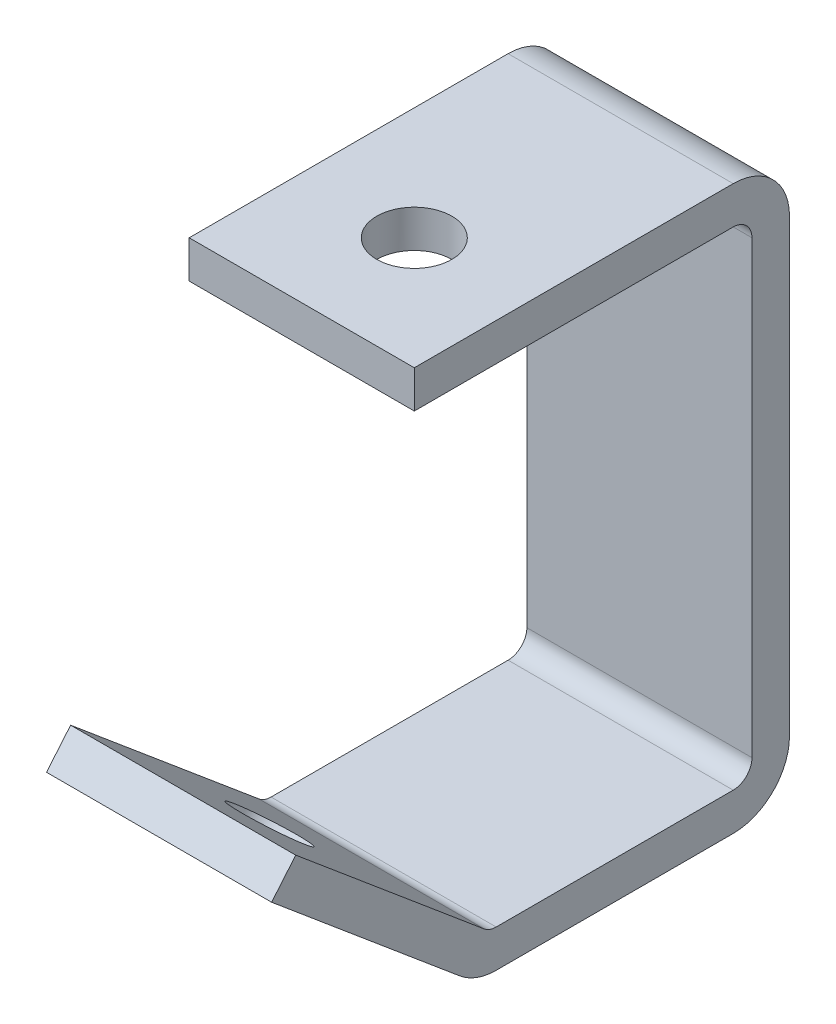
ISO-10303-21;
HEADER;
FILE_DESCRIPTION(('STEP AP214'),'2;1');
FILE_NAME('part.step','',(''),(''),'','','');
FILE_SCHEMA(('AUTOMOTIVE_DESIGN { 1 0 10303 214 1 1 1 1 }'));
ENDSEC;
DATA;
#1=APPLICATION_CONTEXT('core data for automotive mechanical design processes');
#2=APPLICATION_PROTOCOL_DEFINITION('international standard','automotive_design',2000,#1);
#3=PRODUCT_CONTEXT('',#1,'mechanical');
#4=PRODUCT('Part','Part','',(#3));
#5=PRODUCT_RELATED_PRODUCT_CATEGORY('part','',(#4));
#6=PRODUCT_DEFINITION_FORMATION('','',#4);
#7=PRODUCT_DEFINITION_CONTEXT('part definition',#1,'design');
#8=PRODUCT_DEFINITION('design','',#6,#7);
#9=PRODUCT_DEFINITION_SHAPE('','',#8);
#10=(LENGTH_UNIT() NAMED_UNIT(*) SI_UNIT(.MILLI.,.METRE.));
#11=(NAMED_UNIT(*) PLANE_ANGLE_UNIT() SI_UNIT($,.RADIAN.));
#12=(NAMED_UNIT(*) SI_UNIT($,.STERADIAN.) SOLID_ANGLE_UNIT());
#13=UNCERTAINTY_MEASURE_WITH_UNIT(LENGTH_MEASURE(1.E-05),#10,'distance_accuracy_value','');
#14=(GEOMETRIC_REPRESENTATION_CONTEXT(3) GLOBAL_UNCERTAINTY_ASSIGNED_CONTEXT((#13)) GLOBAL_UNIT_ASSIGNED_CONTEXT((#10,
#11,#12)) REPRESENTATION_CONTEXT('',''));
#15=CARTESIAN_POINT('',(0.,0.,0.));
#16=DIRECTION('',(0.,0.,1.));
#17=DIRECTION('',(1.,0.,0.));
#18=AXIS2_PLACEMENT_3D('',#15,#16,#17);
#19=CARTESIAN_POINT('',(19.05,88.9,3.175));
#20=DIRECTION('',(0.,-1.,0.));
#21=DIRECTION('',(0.,0.,-1.));
#22=AXIS2_PLACEMENT_3D('',#19,#20,#21);
#23=PLANE('',#22);
#24=CARTESIAN_POINT('',(0.,88.9,38.1));
#25=DIRECTION('',(0.,1.,0.));
#26=DIRECTION('',(0.,0.,1.));
#27=AXIS2_PLACEMENT_3D('',#24,#25,#26);
#28=CIRCLE('',#27,6.35);
#29=CARTESIAN_POINT('',(0.,88.9,44.45));
#30=VERTEX_POINT('',#29);
#31=EDGE_CURVE('E179',#30,#30,#28,.T.);
#32=ORIENTED_EDGE('',*,*,#31,.F.);
#33=EDGE_LOOP('',(#32));
#34=FACE_BOUND('',#33,.T.);
#35=DIRECTION('',(0.,0.,1.));
#36=VECTOR('',#35,1.);
#37=CARTESIAN_POINT('',(-19.05,88.9,3.175));
#38=LINE('',#37,#36);
#39=CARTESIAN_POINT('',(-19.05,88.9,3.175));
#40=VERTEX_POINT('',#39);
#41=CARTESIAN_POINT('',(-19.05,88.9,57.15));
#42=VERTEX_POINT('',#41);
#43=EDGE_CURVE('E175',#40,#42,#38,.T.);
#44=ORIENTED_EDGE('',*,*,#43,.T.);
#45=DIRECTION('',(-1.,0.,0.));
#46=VECTOR('',#45,1.);
#47=CARTESIAN_POINT('',(19.05,88.9,57.15));
#48=LINE('',#47,#46);
#49=CARTESIAN_POINT('',(19.05,88.9,57.15));
#50=VERTEX_POINT('',#49);
#51=EDGE_CURVE('E11',#50,#42,#48,.T.);
#52=ORIENTED_EDGE('',*,*,#51,.F.);
#53=DIRECTION('',(0.,0.,1.));
#54=VECTOR('',#53,1.);
#55=CARTESIAN_POINT('',(19.05,88.9,3.175));
#56=LINE('',#55,#54);
#57=CARTESIAN_POINT('',(19.05,88.9,3.175));
#58=VERTEX_POINT('',#57);
#59=EDGE_CURVE('E112',#58,#50,#56,.T.);
#60=ORIENTED_EDGE('',*,*,#59,.F.);
#61=DIRECTION('',(-1.,0.,0.));
#62=VECTOR('',#61,1.);
#63=CARTESIAN_POINT('',(19.05,88.9,3.175));
#64=LINE('',#63,#62);
#65=EDGE_CURVE('E171',#58,#40,#64,.T.);
#66=ORIENTED_EDGE('',*,*,#65,.T.);
#67=EDGE_LOOP('',(#44,#52,#60,#66));
#68=FACE_BOUND('',#67,.T.);
#69=ADVANCED_FACE('F32',(#34,#68),#23,.F.);
#70=CARTESIAN_POINT('',(19.05,82.55,57.15));
#71=DIRECTION('',(0.,0.,1.));
#72=DIRECTION('',(1.,0.,0.));
#73=AXIS2_PLACEMENT_3D('',#70,#71,#72);
#74=PLANE('',#73);
#75=DIRECTION('',(0.,1.,0.));
#76=VECTOR('',#75,1.);
#77=CARTESIAN_POINT('',(-19.05,82.55,57.15));
#78=LINE('',#77,#76);
#79=CARTESIAN_POINT('',(-19.05,82.55,57.15));
#80=VERTEX_POINT('',#79);
#81=EDGE_CURVE('E178',#80,#42,#78,.T.);
#82=ORIENTED_EDGE('',*,*,#81,.F.);
#83=DIRECTION('',(-1.,0.,0.));
#84=VECTOR('',#83,1.);
#85=CARTESIAN_POINT('',(19.05,82.55,57.15));
#86=LINE('',#85,#84);
#87=CARTESIAN_POINT('',(19.05,82.55,57.15));
#88=VERTEX_POINT('',#87);
#89=EDGE_CURVE('E40',#88,#80,#86,.T.);
#90=ORIENTED_EDGE('',*,*,#89,.F.);
#91=DIRECTION('',(0.,1.,0.));
#92=VECTOR('',#91,1.);
#93=CARTESIAN_POINT('',(19.05,82.55,57.15));
#94=LINE('',#93,#92);
#95=EDGE_CURVE('E261',#88,#50,#94,.T.);
#96=ORIENTED_EDGE('',*,*,#95,.T.);
#97=ORIENTED_EDGE('',*,*,#51,.T.);
#98=EDGE_LOOP('',(#82,#90,#96,#97));
#99=FACE_BOUND('',#98,.T.);
#100=ADVANCED_FACE('F248',(#99),#74,.T.);
#101=CARTESIAN_POINT('',(19.05,82.55,3.175));
#102=DIRECTION('',(0.,-1.,0.));
#103=DIRECTION('',(0.,0.,-1.));
#104=AXIS2_PLACEMENT_3D('',#101,#102,#103);
#105=PLANE('',#104);
#106=CARTESIAN_POINT('',(0.,82.55,38.1));
#107=DIRECTION('',(0.,-1.,0.));
#108=DIRECTION('',(0.,0.,-1.));
#109=AXIS2_PLACEMENT_3D('',#106,#107,#108);
#110=CIRCLE('',#109,6.35);
#111=CARTESIAN_POINT('',(0.,82.55,31.75));
#112=VERTEX_POINT('',#111);
#113=EDGE_CURVE('E317',#112,#112,#110,.F.);
#114=ORIENTED_EDGE('',*,*,#113,.T.);
#115=EDGE_LOOP('',(#114));
#116=FACE_BOUND('',#115,.T.);
#117=DIRECTION('',(0.,0.,1.));
#118=VECTOR('',#117,1.);
#119=CARTESIAN_POINT('',(-19.05,82.55,3.175));
#120=LINE('',#119,#118);
#121=CARTESIAN_POINT('',(-19.05,82.55,3.175));
#122=VERTEX_POINT('',#121);
#123=EDGE_CURVE('E182',#122,#80,#120,.T.);
#124=ORIENTED_EDGE('',*,*,#123,.F.);
#125=DIRECTION('',(-1.,0.,0.));
#126=VECTOR('',#125,1.);
#127=CARTESIAN_POINT('',(19.05,82.55,3.175));
#128=LINE('',#127,#126);
#129=CARTESIAN_POINT('',(19.05,82.55,3.175));
#130=VERTEX_POINT('',#129);
#131=EDGE_CURVE('E238',#130,#122,#128,.T.);
#132=ORIENTED_EDGE('',*,*,#131,.F.);
#133=DIRECTION('',(0.,0.,1.));
#134=VECTOR('',#133,1.);
#135=CARTESIAN_POINT('',(19.05,82.55,3.175));
#136=LINE('',#135,#134);
#137=EDGE_CURVE('E245',#130,#88,#136,.T.);
#138=ORIENTED_EDGE('',*,*,#137,.T.);
#139=ORIENTED_EDGE('',*,*,#89,.T.);
#140=EDGE_LOOP('',(#124,#132,#138,#139));
#141=FACE_BOUND('',#140,.T.);
#142=ADVANCED_FACE('F243',(#116,#141),#105,.T.);
#143=CARTESIAN_POINT('',(19.05,79.375,3.175));
#144=DIRECTION('',(-1.,0.,0.));
#145=DIRECTION('',(0.,0.,1.));
#146=AXIS2_PLACEMENT_3D('',#143,#144,#145);
#147=CYLINDRICAL_SURFACE('',#146,3.175);
#148=CARTESIAN_POINT('',(-19.05,79.375,3.175));
#149=DIRECTION('',(1.,0.,0.));
#150=DIRECTION('',(0.,0.,-1.));
#151=AXIS2_PLACEMENT_3D('',#148,#149,#150);
#152=CIRCLE('',#151,3.175);
#153=CARTESIAN_POINT('',(-19.05,79.375,0.));
#154=VERTEX_POINT('',#153);
#155=EDGE_CURVE('E185',#154,#122,#152,.T.);
#156=ORIENTED_EDGE('',*,*,#155,.F.);
#157=DIRECTION('',(-1.,0.,0.));
#158=VECTOR('',#157,1.);
#159=CARTESIAN_POINT('',(19.05,79.375,0.));
#160=LINE('',#159,#158);
#161=CARTESIAN_POINT('',(19.05,79.375,0.));
#162=VERTEX_POINT('',#161);
#163=EDGE_CURVE('E236',#162,#154,#160,.T.);
#164=ORIENTED_EDGE('',*,*,#163,.F.);
#165=CARTESIAN_POINT('',(19.05,79.375,3.175));
#166=DIRECTION('',(1.,0.,0.));
#167=DIRECTION('',(0.,0.,-1.));
#168=AXIS2_PLACEMENT_3D('',#165,#166,#167);
#169=CIRCLE('',#168,3.175);
#170=EDGE_CURVE('E258',#162,#130,#169,.T.);
#171=ORIENTED_EDGE('',*,*,#170,.T.);
#172=ORIENTED_EDGE('',*,*,#131,.T.);
#173=EDGE_LOOP('',(#156,#164,#171,#172));
#174=FACE_BOUND('',#173,.T.);
#175=ADVANCED_FACE('F255',(#174),#147,.F.);
#176=CARTESIAN_POINT('',(19.05,3.175,0.));
#177=DIRECTION('',(0.,0.,1.));
#178=DIRECTION('',(1.,0.,0.));
#179=AXIS2_PLACEMENT_3D('',#176,#177,#178);
#180=PLANE('',#179);
#181=DIRECTION('',(0.,1.,0.));
#182=VECTOR('',#181,1.);
#183=CARTESIAN_POINT('',(-19.05,3.175,0.));
#184=LINE('',#183,#182);
#185=CARTESIAN_POINT('',(-19.05,3.175,0.));
#186=VERTEX_POINT('',#185);
#187=EDGE_CURVE('E188',#186,#154,#184,.T.);
#188=ORIENTED_EDGE('',*,*,#187,.F.);
#189=DIRECTION('',(-1.,0.,0.));
#190=VECTOR('',#189,1.);
#191=CARTESIAN_POINT('',(19.05,3.175,0.));
#192=LINE('',#191,#190);
#193=CARTESIAN_POINT('',(19.05,3.175,0.));
#194=VERTEX_POINT('',#193);
#195=EDGE_CURVE('E234',#194,#186,#192,.T.);
#196=ORIENTED_EDGE('',*,*,#195,.F.);
#197=DIRECTION('',(0.,1.,0.));
#198=VECTOR('',#197,1.);
#199=CARTESIAN_POINT('',(19.05,3.175,0.));
#200=LINE('',#199,#198);
#201=EDGE_CURVE('E263',#194,#162,#200,.T.);
#202=ORIENTED_EDGE('',*,*,#201,.T.);
#203=ORIENTED_EDGE('',*,*,#163,.T.);
#204=EDGE_LOOP('',(#188,#196,#202,#203));
#205=FACE_BOUND('',#204,.T.);
#206=ADVANCED_FACE('F362',(#205),#180,.T.);
#207=CARTESIAN_POINT('',(19.05,3.175,3.175));
#208=DIRECTION('',(-1.,0.,0.));
#209=DIRECTION('',(0.,0.,1.));
#210=AXIS2_PLACEMENT_3D('',#207,#208,#209);
#211=CYLINDRICAL_SURFACE('',#210,3.175);
#212=CARTESIAN_POINT('',(-19.05,3.175,3.175));
#213=DIRECTION('',(1.,0.,0.));
#214=DIRECTION('',(0.,0.,1.));
#215=AXIS2_PLACEMENT_3D('',#212,#213,#214);
#216=CIRCLE('',#215,3.175);
#217=CARTESIAN_POINT('',(-19.05,0.,3.175));
#218=VERTEX_POINT('',#217);
#219=EDGE_CURVE('E191',#218,#186,#216,.T.);
#220=ORIENTED_EDGE('',*,*,#219,.F.);
#221=DIRECTION('',(-1.,0.,0.));
#222=VECTOR('',#221,1.);
#223=CARTESIAN_POINT('',(19.05,0.,3.175));
#224=LINE('',#223,#222);
#225=CARTESIAN_POINT('',(19.05,0.,3.175));
#226=VERTEX_POINT('',#225);
#227=EDGE_CURVE('E232',#226,#218,#224,.T.);
#228=ORIENTED_EDGE('',*,*,#227,.F.);
#229=CARTESIAN_POINT('',(19.05,3.175,3.175));
#230=DIRECTION('',(1.,0.,0.));
#231=DIRECTION('',(0.,0.,1.));
#232=AXIS2_PLACEMENT_3D('',#229,#230,#231);
#233=CIRCLE('',#232,3.175);
#234=EDGE_CURVE('E269',#226,#194,#233,.T.);
#235=ORIENTED_EDGE('',*,*,#234,.T.);
#236=ORIENTED_EDGE('',*,*,#195,.T.);
#237=EDGE_LOOP('',(#220,#228,#235,#236));
#238=FACE_BOUND('',#237,.T.);
#239=ADVANCED_FACE('F360',(#238),#211,.F.);
#240=CARTESIAN_POINT('',(19.05,0.,43.2943945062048));
#241=DIRECTION('',(0.,1.,0.));
#242=DIRECTION('',(0.,0.,1.));
#243=AXIS2_PLACEMENT_3D('',#240,#241,#242);
#244=PLANE('',#243);
#245=DIRECTION('',(0.,0.,-1.));
#246=VECTOR('',#245,1.);
#247=CARTESIAN_POINT('',(-19.05,0.,43.2943945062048));
#248=LINE('',#247,#246);
#249=CARTESIAN_POINT('',(-19.05,0.,43.2943945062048));
#250=VERTEX_POINT('',#249);
#251=EDGE_CURVE('E194',#250,#218,#248,.T.);
#252=ORIENTED_EDGE('',*,*,#251,.F.);
#253=DIRECTION('',(-1.,0.,0.));
#254=VECTOR('',#253,1.);
#255=CARTESIAN_POINT('',(19.05,0.,43.2943945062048));
#256=LINE('',#255,#254);
#257=CARTESIAN_POINT('',(19.05,0.,43.2943945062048));
#258=VERTEX_POINT('',#257);
#259=EDGE_CURVE('E230',#258,#250,#256,.T.);
#260=ORIENTED_EDGE('',*,*,#259,.F.);
#261=DIRECTION('',(0.,0.,-1.));
#262=VECTOR('',#261,1.);
#263=CARTESIAN_POINT('',(19.05,0.,43.2943945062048));
#264=LINE('',#263,#262);
#265=EDGE_CURVE('E272',#258,#226,#264,.T.);
#266=ORIENTED_EDGE('',*,*,#265,.T.);
#267=ORIENTED_EDGE('',*,*,#227,.T.);
#268=EDGE_LOOP('',(#252,#260,#266,#267));
#269=FACE_BOUND('',#268,.T.);
#270=ADVANCED_FACE('F356',(#269),#244,.T.);
#271=CARTESIAN_POINT('',(19.05,3.175,43.2943945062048));
#272=DIRECTION('',(-1.,0.,0.));
#273=DIRECTION('',(0.,0.,1.));
#274=AXIS2_PLACEMENT_3D('',#271,#272,#273);
#275=CYLINDRICAL_SURFACE('',#274,3.175);
#276=CARTESIAN_POINT('',(-19.05,3.175,43.2943945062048));
#277=DIRECTION('',(1.,0.,0.));
#278=DIRECTION('',(0.,0.,-1.));
#279=AXIS2_PLACEMENT_3D('',#276,#277,#278);
#280=CIRCLE('',#279,3.175);
#281=CARTESIAN_POINT('',(-19.05,0.742808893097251,45.3352451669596));
#282=VERTEX_POINT('',#281);
#283=EDGE_CURVE('E197',#282,#250,#280,.T.);
#284=ORIENTED_EDGE('',*,*,#283,.F.);
#285=DIRECTION('',(-1.,0.,0.));
#286=VECTOR('',#285,1.);
#287=CARTESIAN_POINT('',(19.05,0.742808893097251,45.3352451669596));
#288=LINE('',#287,#286);
#289=CARTESIAN_POINT('',(19.05,0.742808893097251,45.3352451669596));
#290=VERTEX_POINT('',#289);
#291=EDGE_CURVE('E228',#290,#282,#288,.T.);
#292=ORIENTED_EDGE('',*,*,#291,.F.);
#293=CARTESIAN_POINT('',(19.05,3.175,43.2943945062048));
#294=DIRECTION('',(1.,0.,0.));
#295=DIRECTION('',(0.,0.,-1.));
#296=AXIS2_PLACEMENT_3D('',#293,#294,#295);
#297=CIRCLE('',#296,3.175);
#298=EDGE_CURVE('E275',#290,#258,#297,.T.);
#299=ORIENTED_EDGE('',*,*,#298,.T.);
#300=ORIENTED_EDGE('',*,*,#259,.T.);
#301=EDGE_LOOP('',(#284,#292,#299,#300));
#302=FACE_BOUND('',#301,.T.);
#303=ADVANCED_FACE('F352',(#302),#275,.F.);
#304=CARTESIAN_POINT('',(19.05,27.4943401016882,77.2164785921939));
#305=DIRECTION('',(0.,0.766044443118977,-0.64278760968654));
#306=DIRECTION('',(0.,0.64278760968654,0.766044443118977));
#307=AXIS2_PLACEMENT_3D('',#304,#305,#306);
#308=PLANE('',#307);
#309=CARTESIAN_POINT('',(0.,15.2389046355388,62.6110193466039));
#310=DIRECTION('',(0.,0.766044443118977,-0.64278760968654));
#311=DIRECTION('',(0.,0.64278760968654,0.766044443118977));
#312=AXIS2_PLACEMENT_3D('',#309,#310,#311);
#313=CIRCLE('',#312,6.);
#314=CARTESIAN_POINT('',(0.,19.095630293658,67.2072860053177));
#315=VERTEX_POINT('',#314);
#316=EDGE_CURVE('E325',#315,#315,#313,.F.);
#317=ORIENTED_EDGE('',*,*,#316,.T.);
#318=EDGE_LOOP('',(#317));
#319=FACE_BOUND('',#318,.T.);
#320=DIRECTION('',(0.,-0.64278760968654,-0.766044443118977));
#321=VECTOR('',#320,1.);
#322=CARTESIAN_POINT('',(-19.05,27.4943401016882,77.2164785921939));
#323=LINE('',#322,#321);
#324=CARTESIAN_POINT('',(-19.05,27.4943401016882,77.2164785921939));
#325=VERTEX_POINT('',#324);
#326=EDGE_CURVE('E200',#325,#282,#323,.T.);
#327=ORIENTED_EDGE('',*,*,#326,.F.);
#328=DIRECTION('',(-1.,0.,0.));
#329=VECTOR('',#328,1.);
#330=CARTESIAN_POINT('',(19.05,27.4943401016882,77.2164785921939));
#331=LINE('',#330,#329);
#332=CARTESIAN_POINT('',(19.05,27.4943401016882,77.2164785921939));
#333=VERTEX_POINT('',#332);
#334=EDGE_CURVE('E226',#333,#325,#331,.T.);
#335=ORIENTED_EDGE('',*,*,#334,.F.);
#336=DIRECTION('',(0.,-0.64278760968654,-0.766044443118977));
#337=VECTOR('',#336,1.);
#338=CARTESIAN_POINT('',(19.05,27.4943401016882,77.2164785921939));
#339=LINE('',#338,#337);
#340=EDGE_CURVE('E278',#333,#290,#339,.T.);
#341=ORIENTED_EDGE('',*,*,#340,.T.);
#342=ORIENTED_EDGE('',*,*,#291,.T.);
#343=EDGE_LOOP('',(#327,#335,#341,#342));
#344=FACE_BOUND('',#343,.T.);
#345=ADVANCED_FACE('F329',(#319,#344),#308,.T.);
#346=CARTESIAN_POINT('',(19.05,22.6299578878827,81.2981799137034));
#347=DIRECTION('',(0.,0.642787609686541,0.766044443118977));
#348=DIRECTION('',(0.,-0.766044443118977,0.642787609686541));
#349=AXIS2_PLACEMENT_3D('',#346,#347,#348);
#350=PLANE('',#349);
#351=DIRECTION('',(0.,0.766044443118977,-0.642787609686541));
#352=VECTOR('',#351,1.);
#353=CARTESIAN_POINT('',(-19.05,22.6299578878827,81.2981799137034));
#354=LINE('',#353,#352);
#355=CARTESIAN_POINT('',(-19.05,22.6299578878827,81.2981799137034));
#356=VERTEX_POINT('',#355);
#357=EDGE_CURVE('E203',#356,#325,#354,.T.);
#358=ORIENTED_EDGE('',*,*,#357,.F.);
#359=DIRECTION('',(-1.,0.,0.));
#360=VECTOR('',#359,1.);
#361=CARTESIAN_POINT('',(19.05,22.6299578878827,81.2981799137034));
#362=LINE('',#361,#360);
#363=CARTESIAN_POINT('',(19.05,22.6299578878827,81.2981799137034));
#364=VERTEX_POINT('',#363);
#365=EDGE_CURVE('E224',#364,#356,#362,.T.);
#366=ORIENTED_EDGE('',*,*,#365,.F.);
#367=DIRECTION('',(0.,0.766044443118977,-0.642787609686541));
#368=VECTOR('',#367,1.);
#369=CARTESIAN_POINT('',(19.05,22.6299578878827,81.2981799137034));
#370=LINE('',#369,#368);
#371=EDGE_CURVE('E281',#364,#333,#370,.T.);
#372=ORIENTED_EDGE('',*,*,#371,.T.);
#373=ORIENTED_EDGE('',*,*,#334,.T.);
#374=EDGE_LOOP('',(#358,#366,#372,#373));
#375=FACE_BOUND('',#374,.T.);
#376=ADVANCED_FACE('F342',(#375),#350,.T.);
#377=CARTESIAN_POINT('',(19.05,22.6299578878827,81.2981799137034));
#378=DIRECTION('',(0.,0.766044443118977,-0.64278760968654));
#379=DIRECTION('',(0.,0.64278760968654,0.766044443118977));
#380=AXIS2_PLACEMENT_3D('',#377,#378,#379);
#381=PLANE('',#380);
#382=CARTESIAN_POINT('',(0.,10.3745224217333,66.6927206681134));
#383=DIRECTION('',(0.,-0.766044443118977,0.64278760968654));
#384=DIRECTION('',(0.,-0.64278760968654,-0.766044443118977));
#385=AXIS2_PLACEMENT_3D('',#382,#383,#384);
#386=CIRCLE('',#385,6.);
#387=CARTESIAN_POINT('',(0.,6.51779676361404,62.0964540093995));
#388=VERTEX_POINT('',#387);
#389=EDGE_CURVE('E320',#388,#388,#386,.T.);
#390=ORIENTED_EDGE('',*,*,#389,.F.);
#391=EDGE_LOOP('',(#390));
#392=FACE_BOUND('',#391,.T.);
#393=DIRECTION('',(0.,-0.64278760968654,-0.766044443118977));
#394=VECTOR('',#393,1.);
#395=CARTESIAN_POINT('',(-19.05,22.6299578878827,81.2981799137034));
#396=LINE('',#395,#394);
#397=CARTESIAN_POINT('',(-19.05,-4.12157332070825,49.4169464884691));
#398=VERTEX_POINT('',#397);
#399=EDGE_CURVE('E206',#356,#398,#396,.T.);
#400=ORIENTED_EDGE('',*,*,#399,.T.);
#401=DIRECTION('',(-1.,0.,0.));
#402=VECTOR('',#401,1.);
#403=CARTESIAN_POINT('',(19.05,-4.12157332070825,49.4169464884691));
#404=LINE('',#403,#402);
#405=CARTESIAN_POINT('',(19.05,-4.12157332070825,49.4169464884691));
#406=VERTEX_POINT('',#405);
#407=EDGE_CURVE('E221',#406,#398,#404,.T.);
#408=ORIENTED_EDGE('',*,*,#407,.F.);
#409=DIRECTION('',(0.,-0.64278760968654,-0.766044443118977));
#410=VECTOR('',#409,1.);
#411=CARTESIAN_POINT('',(19.05,22.6299578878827,81.2981799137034));
#412=LINE('',#411,#410);
#413=EDGE_CURVE('E284',#364,#406,#412,.T.);
#414=ORIENTED_EDGE('',*,*,#413,.F.);
#415=ORIENTED_EDGE('',*,*,#365,.T.);
#416=EDGE_LOOP('',(#400,#408,#414,#415));
#417=FACE_BOUND('',#416,.T.);
#418=ADVANCED_FACE('F339',(#392,#417),#381,.F.);
#419=CARTESIAN_POINT('',(19.05,3.175,43.2943945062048));
#420=DIRECTION('',(-1.,0.,0.));
#421=DIRECTION('',(0.,0.,1.));
#422=AXIS2_PLACEMENT_3D('',#419,#420,#421);
#423=CYLINDRICAL_SURFACE('',#422,9.525);
#424=CARTESIAN_POINT('',(-19.05,3.175,43.2943945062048));
#425=DIRECTION('',(1.,0.,0.));
#426=DIRECTION('',(0.,0.,-1.));
#427=AXIS2_PLACEMENT_3D('',#424,#425,#426);
#428=CIRCLE('',#427,9.525);
#429=CARTESIAN_POINT('',(-19.05,-6.35,43.2943945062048));
#430=VERTEX_POINT('',#429);
#431=EDGE_CURVE('E208',#398,#430,#428,.T.);
#432=ORIENTED_EDGE('',*,*,#431,.T.);
#433=DIRECTION('',(-1.,0.,0.));
#434=VECTOR('',#433,1.);
#435=CARTESIAN_POINT('',(19.05,-6.35,43.2943945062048));
#436=LINE('',#435,#434);
#437=CARTESIAN_POINT('',(19.05,-6.35,43.2943945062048));
#438=VERTEX_POINT('',#437);
#439=EDGE_CURVE('E218',#438,#430,#436,.T.);
#440=ORIENTED_EDGE('',*,*,#439,.F.);
#441=CARTESIAN_POINT('',(19.05,3.175,43.2943945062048));
#442=DIRECTION('',(1.,0.,0.));
#443=DIRECTION('',(0.,0.,-1.));
#444=AXIS2_PLACEMENT_3D('',#441,#442,#443);
#445=CIRCLE('',#444,9.525);
#446=EDGE_CURVE('E286',#406,#438,#445,.T.);
#447=ORIENTED_EDGE('',*,*,#446,.F.);
#448=ORIENTED_EDGE('',*,*,#407,.T.);
#449=EDGE_LOOP('',(#432,#440,#447,#448));
#450=FACE_BOUND('',#449,.T.);
#451=ADVANCED_FACE('F293',(#450),#423,.T.);
#452=CARTESIAN_POINT('',(19.05,-6.35,43.2943945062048));
#453=DIRECTION('',(0.,1.,0.));
#454=DIRECTION('',(0.,0.,1.));
#455=AXIS2_PLACEMENT_3D('',#452,#453,#454);
#456=PLANE('',#455);
#457=DIRECTION('',(0.,0.,-1.));
#458=VECTOR('',#457,1.);
#459=CARTESIAN_POINT('',(-19.05,-6.35,43.2943945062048));
#460=LINE('',#459,#458);
#461=CARTESIAN_POINT('',(-19.05,-6.35,3.17499999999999));
#462=VERTEX_POINT('',#461);
#463=EDGE_CURVE('E210',#430,#462,#460,.T.);
#464=ORIENTED_EDGE('',*,*,#463,.T.);
#465=DIRECTION('',(-1.,0.,0.));
#466=VECTOR('',#465,1.);
#467=CARTESIAN_POINT('',(19.05,-6.35,3.17499999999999));
#468=LINE('',#467,#466);
#469=CARTESIAN_POINT('',(19.05,-6.35,3.17499999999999));
#470=VERTEX_POINT('',#469);
#471=EDGE_CURVE('E166',#470,#462,#468,.T.);
#472=ORIENTED_EDGE('',*,*,#471,.F.);
#473=DIRECTION('',(0.,0.,-1.));
#474=VECTOR('',#473,1.);
#475=CARTESIAN_POINT('',(19.05,-6.35,43.2943945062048));
#476=LINE('',#475,#474);
#477=EDGE_CURVE('E157',#438,#470,#476,.T.);
#478=ORIENTED_EDGE('',*,*,#477,.F.);
#479=ORIENTED_EDGE('',*,*,#439,.T.);
#480=EDGE_LOOP('',(#464,#472,#478,#479));
#481=FACE_BOUND('',#480,.T.);
#482=ADVANCED_FACE('F297',(#481),#456,.F.);
#483=CARTESIAN_POINT('',(19.05,3.175,3.175));
#484=DIRECTION('',(-1.,0.,0.));
#485=DIRECTION('',(0.,0.,1.));
#486=AXIS2_PLACEMENT_3D('',#483,#484,#485);
#487=CYLINDRICAL_SURFACE('',#486,9.525);
#488=CARTESIAN_POINT('',(-19.05,3.175,3.175));
#489=DIRECTION('',(1.,0.,0.));
#490=DIRECTION('',(0.,0.,-1.));
#491=AXIS2_PLACEMENT_3D('',#488,#489,#490);
#492=CIRCLE('',#491,9.525);
#493=CARTESIAN_POINT('',(-19.05,3.175,-6.35));
#494=VERTEX_POINT('',#493);
#495=EDGE_CURVE('E165',#462,#494,#492,.T.);
#496=ORIENTED_EDGE('',*,*,#495,.T.);
#497=DIRECTION('',(-1.,0.,0.));
#498=VECTOR('',#497,1.);
#499=CARTESIAN_POINT('',(19.05,3.175,-6.35));
#500=LINE('',#499,#498);
#501=CARTESIAN_POINT('',(19.05,3.175,-6.35));
#502=VERTEX_POINT('',#501);
#503=EDGE_CURVE('E162',#502,#494,#500,.T.);
#504=ORIENTED_EDGE('',*,*,#503,.F.);
#505=CARTESIAN_POINT('',(19.05,3.175,3.175));
#506=DIRECTION('',(1.,0.,0.));
#507=DIRECTION('',(0.,0.,-1.));
#508=AXIS2_PLACEMENT_3D('',#505,#506,#507);
#509=CIRCLE('',#508,9.525);
#510=EDGE_CURVE('E151',#470,#502,#509,.T.);
#511=ORIENTED_EDGE('',*,*,#510,.F.);
#512=ORIENTED_EDGE('',*,*,#471,.T.);
#513=EDGE_LOOP('',(#496,#504,#511,#512));
#514=FACE_BOUND('',#513,.T.);
#515=ADVANCED_FACE('F163',(#514),#487,.T.);
#516=CARTESIAN_POINT('',(19.05,3.175,-6.35));
#517=DIRECTION('',(0.,0.,1.));
#518=DIRECTION('',(1.,0.,0.));
#519=AXIS2_PLACEMENT_3D('',#516,#517,#518);
#520=PLANE('',#519);
#521=DIRECTION('',(0.,1.,0.));
#522=VECTOR('',#521,1.);
#523=CARTESIAN_POINT('',(-19.05,3.175,-6.35));
#524=LINE('',#523,#522);
#525=CARTESIAN_POINT('',(-19.05,79.375,-6.35));
#526=VERTEX_POINT('',#525);
#527=EDGE_CURVE('E100',#494,#526,#524,.T.);
#528=ORIENTED_EDGE('',*,*,#527,.T.);
#529=DIRECTION('',(-1.,0.,0.));
#530=VECTOR('',#529,1.);
#531=CARTESIAN_POINT('',(19.05,79.375,-6.35));
#532=LINE('',#531,#530);
#533=CARTESIAN_POINT('',(19.05,79.375,-6.35));
#534=VERTEX_POINT('',#533);
#535=EDGE_CURVE('E167',#534,#526,#532,.T.);
#536=ORIENTED_EDGE('',*,*,#535,.F.);
#537=DIRECTION('',(0.,1.,0.));
#538=VECTOR('',#537,1.);
#539=CARTESIAN_POINT('',(19.05,3.175,-6.35));
#540=LINE('',#539,#538);
#541=EDGE_CURVE('E155',#502,#534,#540,.T.);
#542=ORIENTED_EDGE('',*,*,#541,.F.);
#543=ORIENTED_EDGE('',*,*,#503,.T.);
#544=EDGE_LOOP('',(#528,#536,#542,#543));
#545=FACE_BOUND('',#544,.T.);
#546=ADVANCED_FACE('F169',(#545),#520,.F.);
#547=CARTESIAN_POINT('',(19.05,79.375,3.175));
#548=DIRECTION('',(-1.,0.,0.));
#549=DIRECTION('',(0.,0.,1.));
#550=AXIS2_PLACEMENT_3D('',#547,#548,#549);
#551=CYLINDRICAL_SURFACE('',#550,9.525);
#552=CARTESIAN_POINT('',(-19.05,79.375,3.175));
#553=DIRECTION('',(1.,0.,0.));
#554=DIRECTION('',(0.,0.,-1.));
#555=AXIS2_PLACEMENT_3D('',#552,#553,#554);
#556=CIRCLE('',#555,9.525);
#557=EDGE_CURVE('E106',#526,#40,#556,.T.);
#558=ORIENTED_EDGE('',*,*,#557,.T.);
#559=ORIENTED_EDGE('',*,*,#65,.F.);
#560=CARTESIAN_POINT('',(19.05,79.375,3.175));
#561=DIRECTION('',(1.,0.,0.));
#562=DIRECTION('',(0.,0.,-1.));
#563=AXIS2_PLACEMENT_3D('',#560,#561,#562);
#564=CIRCLE('',#563,9.525);
#565=EDGE_CURVE('E48',#534,#58,#564,.T.);
#566=ORIENTED_EDGE('',*,*,#565,.F.);
#567=ORIENTED_EDGE('',*,*,#535,.T.);
#568=EDGE_LOOP('',(#558,#559,#566,#567));
#569=FACE_BOUND('',#568,.T.);
#570=ADVANCED_FACE('F299',(#569),#551,.T.);
#571=CARTESIAN_POINT('',(19.05,79.375,3.175));
#572=DIRECTION('',(1.,0.,0.));
#573=DIRECTION('',(0.,0.,-1.));
#574=AXIS2_PLACEMENT_3D('',#571,#572,#573);
#575=PLANE('',#574);
#576=ORIENTED_EDGE('',*,*,#59,.T.);
#577=ORIENTED_EDGE('',*,*,#95,.F.);
#578=ORIENTED_EDGE('',*,*,#137,.F.);
#579=ORIENTED_EDGE('',*,*,#170,.F.);
#580=ORIENTED_EDGE('',*,*,#201,.F.);
#581=ORIENTED_EDGE('',*,*,#234,.F.);
#582=ORIENTED_EDGE('',*,*,#265,.F.);
#583=ORIENTED_EDGE('',*,*,#298,.F.);
#584=ORIENTED_EDGE('',*,*,#340,.F.);
#585=ORIENTED_EDGE('',*,*,#371,.F.);
#586=ORIENTED_EDGE('',*,*,#413,.T.);
#587=ORIENTED_EDGE('',*,*,#446,.T.);
#588=ORIENTED_EDGE('',*,*,#477,.T.);
#589=ORIENTED_EDGE('',*,*,#510,.T.);
#590=ORIENTED_EDGE('',*,*,#541,.T.);
#591=ORIENTED_EDGE('',*,*,#565,.T.);
#592=EDGE_LOOP('',(#576,#577,#578,#579,#580,#581,#582,#583,#584,#585,#586,#587,#588,#589,#590,#591));
#593=FACE_BOUND('',#592,.T.);
#594=ADVANCED_FACE('F153',(#593),#575,.T.);
#595=CARTESIAN_POINT('',(-19.05,79.375,3.175));
#596=DIRECTION('',(1.,0.,0.));
#597=DIRECTION('',(0.,0.,-1.));
#598=AXIS2_PLACEMENT_3D('',#595,#596,#597);
#599=PLANE('',#598);
#600=ORIENTED_EDGE('',*,*,#43,.F.);
#601=ORIENTED_EDGE('',*,*,#557,.F.);
#602=ORIENTED_EDGE('',*,*,#527,.F.);
#603=ORIENTED_EDGE('',*,*,#495,.F.);
#604=ORIENTED_EDGE('',*,*,#463,.F.);
#605=ORIENTED_EDGE('',*,*,#431,.F.);
#606=ORIENTED_EDGE('',*,*,#399,.F.);
#607=ORIENTED_EDGE('',*,*,#357,.T.);
#608=ORIENTED_EDGE('',*,*,#326,.T.);
#609=ORIENTED_EDGE('',*,*,#283,.T.);
#610=ORIENTED_EDGE('',*,*,#251,.T.);
#611=ORIENTED_EDGE('',*,*,#219,.T.);
#612=ORIENTED_EDGE('',*,*,#187,.T.);
#613=ORIENTED_EDGE('',*,*,#155,.T.);
#614=ORIENTED_EDGE('',*,*,#123,.T.);
#615=ORIENTED_EDGE('',*,*,#81,.T.);
#616=EDGE_LOOP('',(#600,#601,#602,#603,#604,#605,#606,#607,#608,#609,#610,#611,#612,#613,#614,#615));
#617=FACE_BOUND('',#616,.T.);
#618=ADVANCED_FACE('F251',(#617),#599,.F.);
#619=CARTESIAN_POINT('',(0.,-6.35100000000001,38.1000000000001));
#620=DIRECTION('',(0.,1.,0.));
#621=DIRECTION('',(0.,0.,1.));
#622=AXIS2_PLACEMENT_3D('',#619,#620,#621);
#623=CYLINDRICAL_SURFACE('',#622,6.35);
#624=ORIENTED_EDGE('',*,*,#113,.F.);
#625=EDGE_LOOP('',(#624));
#626=FACE_BOUND('',#625,.T.);
#627=ORIENTED_EDGE('',*,*,#31,.T.);
#628=EDGE_LOOP('',(#627));
#629=FACE_BOUND('',#628,.T.);
#630=ADVANCED_FACE('F335',(#626,#629),#623,.F.);
#631=CARTESIAN_POINT('',(0.,92.4227622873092,-2.1539271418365));
#632=DIRECTION('',(0.,-0.766044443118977,0.64278760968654));
#633=DIRECTION('',(0.,-0.64278760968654,-0.766044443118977));
#634=AXIS2_PLACEMENT_3D('',#631,#632,#633);
#635=CYLINDRICAL_SURFACE('',#634,6.);
#636=ORIENTED_EDGE('',*,*,#316,.F.);
#637=EDGE_LOOP('',(#636));
#638=FACE_BOUND('',#637,.T.);
#639=ORIENTED_EDGE('',*,*,#389,.T.);
#640=EDGE_LOOP('',(#639));
#641=FACE_BOUND('',#640,.T.);
#642=ADVANCED_FACE('F332',(#638,#641),#635,.F.);
#643=CLOSED_SHELL('',(#69,#100,#142,#175,#206,#239,#270,#303,#345,#376,#418,#451,#482,#515,#546,
#570,#594,#618,#630,#642));
#644=MANIFOLD_SOLID_BREP('B2',#643);
#645=ADVANCED_BREP_SHAPE_REPRESENTATION('',(#18,#644),#14);
#646=SHAPE_DEFINITION_REPRESENTATION(#9,#645);
ENDSEC;
END-ISO-10303-21;
